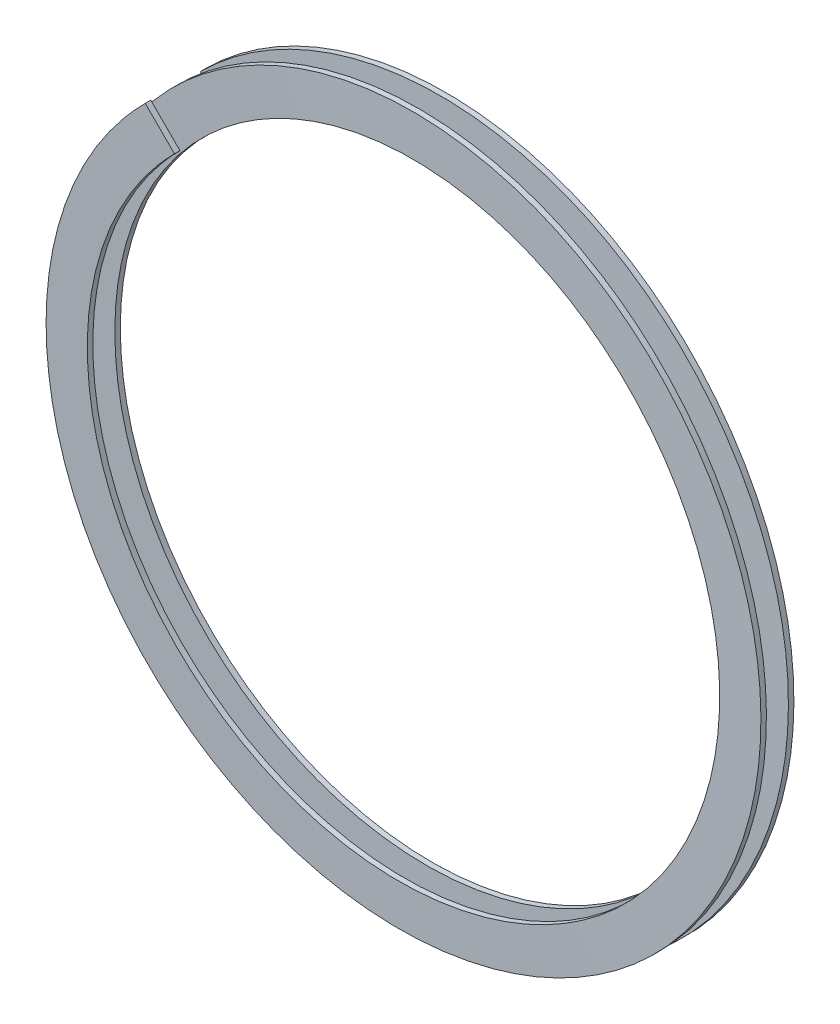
ISO-10303-21;
HEADER;
FILE_DESCRIPTION(('STEP AP214'),'2;1');
FILE_NAME('part.step','',(''),(''),'','','');
FILE_SCHEMA(('AUTOMOTIVE_DESIGN { 1 0 10303 214 1 1 1 1 }'));
ENDSEC;
DATA;
#1=APPLICATION_CONTEXT('core data for automotive mechanical design processes');
#2=APPLICATION_PROTOCOL_DEFINITION('international standard','automotive_design',2000,#1);
#3=PRODUCT_CONTEXT('',#1,'mechanical');
#4=PRODUCT('Part','Part','',(#3));
#5=PRODUCT_RELATED_PRODUCT_CATEGORY('part','',(#4));
#6=PRODUCT_DEFINITION_FORMATION('','',#4);
#7=PRODUCT_DEFINITION_CONTEXT('part definition',#1,'design');
#8=PRODUCT_DEFINITION('design','',#6,#7);
#9=PRODUCT_DEFINITION_SHAPE('','',#8);
#10=(LENGTH_UNIT() NAMED_UNIT(*) SI_UNIT(.MILLI.,.METRE.));
#11=(NAMED_UNIT(*) PLANE_ANGLE_UNIT() SI_UNIT($,.RADIAN.));
#12=(NAMED_UNIT(*) SI_UNIT($,.STERADIAN.) SOLID_ANGLE_UNIT());
#13=UNCERTAINTY_MEASURE_WITH_UNIT(LENGTH_MEASURE(1.E-05),#10,'distance_accuracy_value','');
#14=(GEOMETRIC_REPRESENTATION_CONTEXT(3) GLOBAL_UNCERTAINTY_ASSIGNED_CONTEXT((#13)) GLOBAL_UNIT_ASSIGNED_CONTEXT((#10,
#11,#12)) REPRESENTATION_CONTEXT('',''));
#15=CARTESIAN_POINT('',(0.,0.,0.));
#16=DIRECTION('',(0.,0.,1.));
#17=DIRECTION('',(1.,0.,0.));
#18=AXIS2_PLACEMENT_3D('',#15,#16,#17);
#19=CARTESIAN_POINT('',(-8.48528137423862,8.48528137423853,0.1));
#20=DIRECTION('',(0.707106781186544,0.707106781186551,0.));
#21=DIRECTION('',(-0.707106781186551,0.707106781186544,0.));
#22=AXIS2_PLACEMENT_3D('',#19,#20,#21);
#23=PLANE('',#22);
#24=CARTESIAN_POINT('',(-9.01561146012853,9.01561146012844,0.1));
#25=CARTESIAN_POINT('',(-8.97141728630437,8.97141728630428,0.1));
#26=CARTESIAN_POINT('',(-8.92722311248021,8.92722311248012,0.1));
#27=CARTESIAN_POINT('',(-8.8388347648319,8.8388347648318,0.1));
#28=CARTESIAN_POINT('',(-8.79464059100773,8.79464059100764,0.1));
#29=CARTESIAN_POINT('',(-8.70625224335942,8.70625224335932,0.1));
#30=CARTESIAN_POINT('',(-8.66205806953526,8.66205806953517,0.1));
#31=CARTESIAN_POINT('',(-8.57366972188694,8.57366972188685,0.1));
#32=CARTESIAN_POINT('',(-8.52947554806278,8.52947554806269,0.1));
#33=CARTESIAN_POINT('',(-8.44108720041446,8.44108720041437,0.1));
#34=CARTESIAN_POINT('',(-8.3968930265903,8.39689302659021,0.1));
#35=CARTESIAN_POINT('',(-8.30850467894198,8.30850467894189,0.1));
#36=CARTESIAN_POINT('',(-8.26431050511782,8.26431050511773,0.1));
#37=CARTESIAN_POINT('',(-8.1759221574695,8.17592215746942,0.1));
#38=CARTESIAN_POINT('',(-8.13172798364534,8.13172798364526,0.1));
#39=CARTESIAN_POINT('',(-8.04333963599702,8.04333963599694,0.1));
#40=CARTESIAN_POINT('',(-7.99914546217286,7.99914546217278,0.1));
#41=CARTESIAN_POINT('',(-7.95495128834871,7.95495128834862,0.1));
#42=B_SPLINE_CURVE_WITH_KNOTS('',3,(#24,#25,#26,#27,#28,#29,#30,#31,#32,#33,#34,#35,#36,#37,#38,
#39,#40,#41),.UNSPECIFIED.,.F.,.F.,(4,2,2,2,2,2,2,2,4),(0.,0.187499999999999,0.374999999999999,
0.5625,0.749999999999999,0.937499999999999,1.125,1.3125,1.5),.UNSPECIFIED.);
#43=CARTESIAN_POINT('',(-9.01561146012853,9.01561146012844,0.1));
#44=VERTEX_POINT('',#43);
#45=CARTESIAN_POINT('',(-7.95495128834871,7.95495128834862,0.1));
#46=VERTEX_POINT('',#45);
#47=EDGE_CURVE('E34',#44,#46,#42,.T.);
#48=ORIENTED_EDGE('',*,*,#47,.F.);
#49=CARTESIAN_POINT('',(-9.01561146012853,9.01561146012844,-0.0999999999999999));
#50=CARTESIAN_POINT('',(-9.01561146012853,9.01561146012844,0.1));
#51=(BOUNDED_CURVE() B_SPLINE_CURVE(1,(#49,#50),.UNSPECIFIED.,.F.,
.F.) B_SPLINE_CURVE_WITH_KNOTS((2,2),(0.941176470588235,1.),
.UNSPECIFIED.) CURVE() GEOMETRIC_REPRESENTATION_ITEM() RATIONAL_B_SPLINE_CURVE((1.,1.)) REPRESENTATION_ITEM(''));
#52=CARTESIAN_POINT('',(-9.01561146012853,9.01561146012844,-0.0999999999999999));
#53=VERTEX_POINT('',#52);
#54=EDGE_CURVE('E70',#53,#44,#51,.T.);
#55=ORIENTED_EDGE('',*,*,#54,.F.);
#56=CARTESIAN_POINT('',(-7.95495128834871,7.95495128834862,-0.1));
#57=CARTESIAN_POINT('',(-7.99914546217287,7.99914546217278,-0.1));
#58=CARTESIAN_POINT('',(-8.04333963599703,8.04333963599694,-0.1));
#59=CARTESIAN_POINT('',(-8.13172798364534,8.13172798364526,-0.1));
#60=CARTESIAN_POINT('',(-8.1759221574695,8.17592215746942,-0.1));
#61=CARTESIAN_POINT('',(-8.26431050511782,8.26431050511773,-0.1));
#62=CARTESIAN_POINT('',(-8.30850467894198,8.30850467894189,-0.1));
#63=CARTESIAN_POINT('',(-8.3968930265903,8.39689302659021,-0.1));
#64=CARTESIAN_POINT('',(-8.44108720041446,8.44108720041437,-0.1));
#65=CARTESIAN_POINT('',(-8.52947554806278,8.52947554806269,-0.1));
#66=CARTESIAN_POINT('',(-8.57366972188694,8.57366972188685,-0.1));
#67=CARTESIAN_POINT('',(-8.66205806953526,8.66205806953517,-0.1));
#68=CARTESIAN_POINT('',(-8.70625224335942,8.70625224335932,-0.1));
#69=CARTESIAN_POINT('',(-8.79464059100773,8.79464059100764,-0.0999999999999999));
#70=CARTESIAN_POINT('',(-8.83883476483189,8.8388347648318,-0.0999999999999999));
#71=CARTESIAN_POINT('',(-8.92722311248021,8.92722311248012,-0.0999999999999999));
#72=CARTESIAN_POINT('',(-8.97141728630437,8.97141728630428,-0.0999999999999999));
#73=CARTESIAN_POINT('',(-9.01561146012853,9.01561146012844,-0.0999999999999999));
#74=B_SPLINE_CURVE_WITH_KNOTS('',3,(#56,#57,#58,#59,#60,#61,#62,#63,#64,#65,#66,#67,#68,#69,#70,
#71,#72,#73),.UNSPECIFIED.,.F.,.F.,(4,2,2,2,2,2,2,2,4),(0.,0.187500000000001,0.375,
0.562499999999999,0.750000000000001,0.937499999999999,1.125,1.3125,1.5),.UNSPECIFIED.);
#75=CARTESIAN_POINT('',(-7.95495128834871,7.95495128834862,-0.1));
#76=VERTEX_POINT('',#75);
#77=EDGE_CURVE('E185',#76,#53,#74,.T.);
#78=ORIENTED_EDGE('',*,*,#77,.F.);
#79=CARTESIAN_POINT('',(-7.95495128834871,7.95495128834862,0.1));
#80=CARTESIAN_POINT('',(-7.95495128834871,7.95495128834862,-0.1));
#81=(BOUNDED_CURVE() B_SPLINE_CURVE(1,(#79,#80),.UNSPECIFIED.,.F.,
.F.) B_SPLINE_CURVE_WITH_KNOTS((2,2),(0.441176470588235,0.5),
.UNSPECIFIED.) CURVE() GEOMETRIC_REPRESENTATION_ITEM() RATIONAL_B_SPLINE_CURVE((1.,1.)) REPRESENTATION_ITEM(''));
#82=EDGE_CURVE('E41',#46,#76,#81,.T.);
#83=ORIENTED_EDGE('',*,*,#82,.F.);
#84=EDGE_LOOP('',(#48,#55,#78,#83));
#85=FACE_BOUND('',#84,.T.);
#86=ADVANCED_FACE('F24',(#85),#23,.F.);
#87=CARTESIAN_POINT('',(-8.48528137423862,8.48528137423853,2.1));
#88=DIRECTION('',(-0.707106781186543,-0.707106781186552,0.));
#89=DIRECTION('',(0.707106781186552,-0.707106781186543,0.));
#90=AXIS2_PLACEMENT_3D('',#87,#88,#89);
#91=PLANE('',#90);
#92=CARTESIAN_POINT('',(-7.95495128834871,7.95495128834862,2.1));
#93=CARTESIAN_POINT('',(-9.01561146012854,9.01561146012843,2.1));
#94=(BOUNDED_CURVE() B_SPLINE_CURVE(1,(#92,#93),.UNSPECIFIED.,.F.,
.F.) B_SPLINE_CURVE_WITH_KNOTS((2,2),(0.,0.441176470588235),
.UNSPECIFIED.) CURVE() GEOMETRIC_REPRESENTATION_ITEM() RATIONAL_B_SPLINE_CURVE((1.,1.)) REPRESENTATION_ITEM(''));
#95=CARTESIAN_POINT('',(-9.01561146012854,9.01561146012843,2.1));
#96=VERTEX_POINT('',#95);
#97=CARTESIAN_POINT('',(-7.95495128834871,7.95495128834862,2.1));
#98=VERTEX_POINT('',#97);
#99=EDGE_CURVE('E11',#96,#98,#94,.F.);
#100=ORIENTED_EDGE('',*,*,#99,.T.);
#101=DIRECTION('',(0.,0.,-1.));
#102=VECTOR('',#101,1.);
#103=CARTESIAN_POINT('',(-7.95495128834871,7.95495128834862,2.));
#104=LINE('',#103,#102);
#105=CARTESIAN_POINT('',(-7.95495128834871,7.95495128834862,1.9));
#106=VERTEX_POINT('',#105);
#107=EDGE_CURVE('E49',#98,#106,#104,.T.);
#108=ORIENTED_EDGE('',*,*,#107,.T.);
#109=DIRECTION('',(-0.707106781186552,0.707106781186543,0.));
#110=VECTOR('',#109,1.);
#111=CARTESIAN_POINT('',(-8.48528137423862,8.48528137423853,1.9));
#112=LINE('',#111,#110);
#113=CARTESIAN_POINT('',(-9.01561146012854,9.01561146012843,1.9));
#114=VERTEX_POINT('',#113);
#115=EDGE_CURVE('E131',#106,#114,#112,.T.);
#116=ORIENTED_EDGE('',*,*,#115,.T.);
#117=DIRECTION('',(0.,0.,1.));
#118=VECTOR('',#117,1.);
#119=CARTESIAN_POINT('',(-9.01561146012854,9.01561146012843,2.));
#120=LINE('',#119,#118);
#121=EDGE_CURVE('E80',#114,#96,#120,.T.);
#122=ORIENTED_EDGE('',*,*,#121,.T.);
#123=EDGE_LOOP('',(#100,#108,#116,#122));
#124=FACE_BOUND('',#123,.T.);
#125=ADVANCED_FACE('F26',(#124),#91,.F.);
#126=CARTESIAN_POINT('',(-9.01561146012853,9.01561146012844,0.1));
#127=CARTESIAN_POINT('',(-3.81044575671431,14.2207771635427,0.183333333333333));
#128=CARTESIAN_POINT('',(3.29994282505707,12.3155542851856,0.266666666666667));
#129=CARTESIAN_POINT('',(10.4103314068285,10.4103314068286,0.35));
#130=CARTESIAN_POINT('',(12.3155542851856,3.29994282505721,0.433333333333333));
#131=CARTESIAN_POINT('',(14.2207771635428,-3.81044575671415,0.516666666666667));
#132=CARTESIAN_POINT('',(9.01561146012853,-9.01561146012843,0.6));
#133=CARTESIAN_POINT('',(3.81044575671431,-14.2207771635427,0.683333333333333));
#134=CARTESIAN_POINT('',(-3.29994282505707,-12.3155542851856,0.766666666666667));
#135=CARTESIAN_POINT('',(-10.4103314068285,-10.4103314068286,0.85));
#136=CARTESIAN_POINT('',(-12.3155542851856,-3.29994282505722,0.933333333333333));
#137=CARTESIAN_POINT('',(-14.2207771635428,3.81044575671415,1.01666666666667));
#138=CARTESIAN_POINT('',(-9.01561146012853,9.01561146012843,1.1));
#139=CARTESIAN_POINT('',(-3.81044575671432,14.2207771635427,1.18333333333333));
#140=CARTESIAN_POINT('',(3.29994282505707,12.3155542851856,1.26666666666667));
#141=CARTESIAN_POINT('',(10.4103314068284,10.4103314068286,1.35));
#142=CARTESIAN_POINT('',(12.3155542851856,3.29994282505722,1.43333333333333));
#143=CARTESIAN_POINT('',(14.2207771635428,-3.81044575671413,1.51666666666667));
#144=CARTESIAN_POINT('',(9.01561146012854,-9.01561146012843,1.6));
#145=CARTESIAN_POINT('',(3.81044575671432,-14.2207771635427,1.68333333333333));
#146=CARTESIAN_POINT('',(-3.29994282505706,-12.3155542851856,1.76666666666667));
#147=CARTESIAN_POINT('',(-10.4103314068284,-10.4103314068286,1.85));
#148=CARTESIAN_POINT('',(-12.3155542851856,-3.29994282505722,1.93333333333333));
#149=CARTESIAN_POINT('',(-14.2207771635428,3.81044575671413,2.01666666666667));
#150=CARTESIAN_POINT('',(-9.01561146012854,9.01561146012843,2.1));
#151=CARTESIAN_POINT('',(-7.95495128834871,7.95495128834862,0.1));
#152=CARTESIAN_POINT('',(-3.36215802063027,12.5477445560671,0.183333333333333));
#153=CARTESIAN_POINT('',(2.9117142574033,10.866665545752,0.266666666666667));
#154=CARTESIAN_POINT('',(9.18558653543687,9.18558653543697,0.35));
#155=CARTESIAN_POINT('',(10.866665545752,2.91171425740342,0.433333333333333));
#156=CARTESIAN_POINT('',(12.5477445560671,-3.36215802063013,0.516666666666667));
#157=CARTESIAN_POINT('',(7.95495128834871,-7.95495128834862,0.6));
#158=CARTESIAN_POINT('',(3.36215802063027,-12.5477445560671,0.683333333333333));
#159=CARTESIAN_POINT('',(-2.9117142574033,-10.866665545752,0.766666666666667));
#160=CARTESIAN_POINT('',(-9.18558653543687,-9.18558653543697,0.85));
#161=CARTESIAN_POINT('',(-10.866665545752,-2.91171425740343,0.933333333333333));
#162=CARTESIAN_POINT('',(-12.5477445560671,3.36215802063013,1.01666666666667));
#163=CARTESIAN_POINT('',(-7.95495128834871,7.95495128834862,1.1));
#164=CARTESIAN_POINT('',(-3.36215802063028,12.5477445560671,1.18333333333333));
#165=CARTESIAN_POINT('',(2.9117142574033,10.866665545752,1.26666666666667));
#166=CARTESIAN_POINT('',(9.18558653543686,9.18558653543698,1.35));
#167=CARTESIAN_POINT('',(10.866665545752,2.91171425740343,1.43333333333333));
#168=CARTESIAN_POINT('',(12.5477445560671,-3.36215802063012,1.51666666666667));
#169=CARTESIAN_POINT('',(7.95495128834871,-7.95495128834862,1.6));
#170=CARTESIAN_POINT('',(3.36215802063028,-12.5477445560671,1.68333333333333));
#171=CARTESIAN_POINT('',(-2.91171425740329,-10.866665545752,1.76666666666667));
#172=CARTESIAN_POINT('',(-9.18558653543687,-9.18558653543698,1.85));
#173=CARTESIAN_POINT('',(-10.866665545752,-2.91171425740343,1.93333333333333));
#174=CARTESIAN_POINT('',(-12.5477445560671,3.36215802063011,2.01666666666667));
#175=CARTESIAN_POINT('',(-7.95495128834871,7.95495128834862,2.1));
#176=(BOUNDED_SURFACE() B_SPLINE_SURFACE(1,2,((#126,#127,#128,#129,#130,#131,#132,#133,#134,
#135,#136,#137,#138,#139,#140,#141,#142,#143,#144,#145,#146,#147,#148,#149,#150),(#151,#152,
#153,#154,#155,#156,#157,#158,#159,#160,#161,#162,#163,#164,#165,#166,#167,#168,#169,#170,#171,
#172,#173,#174,#175)),.UNSPECIFIED.,.F.,.F.,.F.) B_SPLINE_SURFACE_WITH_KNOTS((2,2),(3,2,2,2,2,2,
2,2,2,2,2,2,3),(0.,0.441176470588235),(0.,0.0833333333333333,0.166666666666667,0.25,
0.333333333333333,0.416666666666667,0.5,0.583333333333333,0.666666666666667,0.75,
0.833333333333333,0.916666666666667,1.),
.UNSPECIFIED.) GEOMETRIC_REPRESENTATION_ITEM() RATIONAL_B_SPLINE_SURFACE(((1.,0.866025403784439,
1.,0.866025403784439,1.,0.866025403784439,1.,0.866025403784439,1.,0.866025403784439,1.,
0.866025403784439,1.,0.866025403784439,1.,0.866025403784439,1.,0.866025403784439,1.,
0.866025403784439,1.,0.866025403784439,1.,0.866025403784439,1.),(1.,0.866025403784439,1.,
0.866025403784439,1.,0.866025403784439,1.,0.866025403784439,1.,0.866025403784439,1.,
0.866025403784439,1.,0.866025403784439,1.,0.866025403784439,1.,0.866025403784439,1.,
0.866025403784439,1.,0.866025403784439,1.,0.866025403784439,1.))) REPRESENTATION_ITEM('') SURFACE());
#177=CARTESIAN_POINT('',(-7.95495128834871,7.95495128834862,0.1));
#178=CARTESIAN_POINT('',(-3.36215802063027,12.5477445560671,0.183333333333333));
#179=CARTESIAN_POINT('',(2.9117142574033,10.866665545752,0.266666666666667));
#180=CARTESIAN_POINT('',(9.18558653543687,9.18558653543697,0.35));
#181=CARTESIAN_POINT('',(10.866665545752,2.91171425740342,0.433333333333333));
#182=CARTESIAN_POINT('',(12.5477445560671,-3.36215802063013,0.516666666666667));
#183=CARTESIAN_POINT('',(7.95495128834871,-7.95495128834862,0.6));
#184=CARTESIAN_POINT('',(3.36215802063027,-12.5477445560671,0.683333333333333));
#185=CARTESIAN_POINT('',(-2.9117142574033,-10.866665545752,0.766666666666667));
#186=CARTESIAN_POINT('',(-9.18558653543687,-9.18558653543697,0.85));
#187=CARTESIAN_POINT('',(-10.866665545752,-2.91171425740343,0.933333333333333));
#188=CARTESIAN_POINT('',(-12.5477445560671,3.36215802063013,1.01666666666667));
#189=CARTESIAN_POINT('',(-7.95495128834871,7.95495128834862,1.1));
#190=CARTESIAN_POINT('',(-3.36215802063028,12.5477445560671,1.18333333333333));
#191=CARTESIAN_POINT('',(2.9117142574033,10.866665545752,1.26666666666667));
#192=CARTESIAN_POINT('',(9.18558653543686,9.18558653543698,1.35));
#193=CARTESIAN_POINT('',(10.866665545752,2.91171425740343,1.43333333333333));
#194=CARTESIAN_POINT('',(12.5477445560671,-3.36215802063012,1.51666666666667));
#195=CARTESIAN_POINT('',(7.95495128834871,-7.95495128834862,1.6));
#196=CARTESIAN_POINT('',(3.36215802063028,-12.5477445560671,1.68333333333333));
#197=CARTESIAN_POINT('',(-2.91171425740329,-10.866665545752,1.76666666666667));
#198=CARTESIAN_POINT('',(-9.18558653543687,-9.18558653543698,1.85));
#199=CARTESIAN_POINT('',(-10.866665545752,-2.91171425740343,1.93333333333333));
#200=CARTESIAN_POINT('',(-12.5477445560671,3.36215802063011,2.01666666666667));
#201=CARTESIAN_POINT('',(-7.95495128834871,7.95495128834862,2.1));
#202=(BOUNDED_CURVE() B_SPLINE_CURVE(2,(#177,#178,#179,#180,#181,#182,#183,#184,#185,#186,#187,
#188,#189,#190,#191,#192,#193,#194,#195,#196,#197,#198,#199,#200,#201),.UNSPECIFIED.,.F.,
.F.) B_SPLINE_CURVE_WITH_KNOTS((3,2,2,2,2,2,2,2,2,2,2,2,3),(0.,0.0833333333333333,
0.166666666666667,0.25,0.333333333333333,0.416666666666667,0.5,0.583333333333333,
0.666666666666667,0.75,0.833333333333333,0.916666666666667,1.),
.UNSPECIFIED.) CURVE() GEOMETRIC_REPRESENTATION_ITEM() RATIONAL_B_SPLINE_CURVE((1.,
0.866025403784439,1.,0.866025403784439,1.,0.866025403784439,1.,0.866025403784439,1.,
0.866025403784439,1.,0.866025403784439,1.,0.866025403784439,1.,0.866025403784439,1.,
0.866025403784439,1.,0.866025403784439,1.,0.866025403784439,1.,0.866025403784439,1.)) REPRESENTATION_ITEM(''));
#203=EDGE_CURVE('E90',#46,#98,#202,.T.);
#204=CARTESIAN_POINT('',(-9.01561146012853,9.01561146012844,0.1));
#205=CARTESIAN_POINT('',(-3.81044575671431,14.2207771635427,0.183333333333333));
#206=CARTESIAN_POINT('',(3.29994282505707,12.3155542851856,0.266666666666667));
#207=CARTESIAN_POINT('',(10.4103314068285,10.4103314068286,0.35));
#208=CARTESIAN_POINT('',(12.3155542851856,3.29994282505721,0.433333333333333));
#209=CARTESIAN_POINT('',(14.2207771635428,-3.81044575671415,0.516666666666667));
#210=CARTESIAN_POINT('',(9.01561146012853,-9.01561146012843,0.6));
#211=CARTESIAN_POINT('',(3.81044575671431,-14.2207771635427,0.683333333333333));
#212=CARTESIAN_POINT('',(-3.29994282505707,-12.3155542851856,0.766666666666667));
#213=CARTESIAN_POINT('',(-10.4103314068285,-10.4103314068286,0.85));
#214=CARTESIAN_POINT('',(-12.3155542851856,-3.29994282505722,0.933333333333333));
#215=CARTESIAN_POINT('',(-14.2207771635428,3.81044575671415,1.01666666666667));
#216=CARTESIAN_POINT('',(-9.01561146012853,9.01561146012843,1.1));
#217=CARTESIAN_POINT('',(-3.81044575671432,14.2207771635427,1.18333333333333));
#218=CARTESIAN_POINT('',(3.29994282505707,12.3155542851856,1.26666666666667));
#219=CARTESIAN_POINT('',(10.4103314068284,10.4103314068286,1.35));
#220=CARTESIAN_POINT('',(12.3155542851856,3.29994282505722,1.43333333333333));
#221=CARTESIAN_POINT('',(14.2207771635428,-3.81044575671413,1.51666666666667));
#222=CARTESIAN_POINT('',(9.01561146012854,-9.01561146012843,1.6));
#223=CARTESIAN_POINT('',(3.81044575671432,-14.2207771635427,1.68333333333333));
#224=CARTESIAN_POINT('',(-3.29994282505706,-12.3155542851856,1.76666666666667));
#225=CARTESIAN_POINT('',(-10.4103314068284,-10.4103314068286,1.85));
#226=CARTESIAN_POINT('',(-12.3155542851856,-3.29994282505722,1.93333333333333));
#227=CARTESIAN_POINT('',(-14.2207771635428,3.81044575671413,2.01666666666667));
#228=CARTESIAN_POINT('',(-9.01561146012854,9.01561146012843,2.1));
#229=(BOUNDED_CURVE() B_SPLINE_CURVE(2,(#204,#205,#206,#207,#208,#209,#210,#211,#212,#213,#214,
#215,#216,#217,#218,#219,#220,#221,#222,#223,#224,#225,#226,#227,#228),.UNSPECIFIED.,.F.,
.F.) B_SPLINE_CURVE_WITH_KNOTS((3,2,2,2,2,2,2,2,2,2,2,2,3),(0.,0.0833333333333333,
0.166666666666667,0.25,0.333333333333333,0.416666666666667,0.5,0.583333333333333,
0.666666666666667,0.75,0.833333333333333,0.916666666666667,1.),
.UNSPECIFIED.) CURVE() GEOMETRIC_REPRESENTATION_ITEM() RATIONAL_B_SPLINE_CURVE((1.,
0.866025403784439,1.,0.866025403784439,1.,0.866025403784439,1.,0.866025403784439,1.,
0.866025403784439,1.,0.866025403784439,1.,0.866025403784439,1.,0.866025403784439,1.,
0.866025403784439,1.,0.866025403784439,1.,0.866025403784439,1.,0.866025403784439,1.)) REPRESENTATION_ITEM(''));
#230=EDGE_CURVE('E74',#44,#96,#229,.T.);
#231=ORIENTED_EDGE('',*,*,#47,.T.);
#232=ORIENTED_EDGE('',*,*,#203,.T.);
#233=ORIENTED_EDGE('',*,*,#99,.F.);
#234=ORIENTED_EDGE('',*,*,#230,.F.);
#235=EDGE_LOOP('',(#231,#232,#233,#234));
#236=FACE_BOUND('',#235,.T.);
#237=ADVANCED_FACE('F85',(#236),#176,.T.);
#238=CARTESIAN_POINT('',(-7.95495128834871,7.95495128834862,0.1));
#239=CARTESIAN_POINT('',(-3.36215802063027,12.5477445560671,0.183333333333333));
#240=CARTESIAN_POINT('',(2.9117142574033,10.866665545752,0.266666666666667));
#241=CARTESIAN_POINT('',(9.18558653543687,9.18558653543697,0.35));
#242=CARTESIAN_POINT('',(10.866665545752,2.91171425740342,0.433333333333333));
#243=CARTESIAN_POINT('',(12.5477445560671,-3.36215802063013,0.516666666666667));
#244=CARTESIAN_POINT('',(7.95495128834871,-7.95495128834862,0.6));
#245=CARTESIAN_POINT('',(3.36215802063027,-12.5477445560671,0.683333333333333));
#246=CARTESIAN_POINT('',(-2.9117142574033,-10.866665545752,0.766666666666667));
#247=CARTESIAN_POINT('',(-9.18558653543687,-9.18558653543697,0.85));
#248=CARTESIAN_POINT('',(-10.866665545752,-2.91171425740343,0.933333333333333));
#249=CARTESIAN_POINT('',(-12.5477445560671,3.36215802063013,1.01666666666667));
#250=CARTESIAN_POINT('',(-7.95495128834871,7.95495128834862,1.1));
#251=CARTESIAN_POINT('',(-3.36215802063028,12.5477445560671,1.18333333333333));
#252=CARTESIAN_POINT('',(2.9117142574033,10.866665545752,1.26666666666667));
#253=CARTESIAN_POINT('',(9.18558653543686,9.18558653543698,1.35));
#254=CARTESIAN_POINT('',(10.866665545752,2.91171425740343,1.43333333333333));
#255=CARTESIAN_POINT('',(12.5477445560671,-3.36215802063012,1.51666666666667));
#256=CARTESIAN_POINT('',(7.95495128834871,-7.95495128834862,1.6));
#257=CARTESIAN_POINT('',(3.36215802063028,-12.5477445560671,1.68333333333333));
#258=CARTESIAN_POINT('',(-2.91171425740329,-10.866665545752,1.76666666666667));
#259=CARTESIAN_POINT('',(-9.18558653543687,-9.18558653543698,1.85));
#260=CARTESIAN_POINT('',(-10.866665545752,-2.91171425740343,1.93333333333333));
#261=CARTESIAN_POINT('',(-12.5477445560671,3.36215802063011,2.01666666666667));
#262=CARTESIAN_POINT('',(-7.95495128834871,7.95495128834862,2.1));
#263=CARTESIAN_POINT('',(-7.95495128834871,7.95495128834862,-0.1));
#264=CARTESIAN_POINT('',(-3.36215802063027,12.5477445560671,-0.0166666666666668));
#265=CARTESIAN_POINT('',(2.9117142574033,10.866665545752,0.0666666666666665));
#266=CARTESIAN_POINT('',(9.18558653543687,9.18558653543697,0.15));
#267=CARTESIAN_POINT('',(10.866665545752,2.91171425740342,0.233333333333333));
#268=CARTESIAN_POINT('',(12.5477445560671,-3.36215802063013,0.316666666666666));
#269=CARTESIAN_POINT('',(7.95495128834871,-7.95495128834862,0.4));
#270=CARTESIAN_POINT('',(3.36215802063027,-12.5477445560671,0.483333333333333));
#271=CARTESIAN_POINT('',(-2.9117142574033,-10.866665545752,0.566666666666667));
#272=CARTESIAN_POINT('',(-9.18558653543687,-9.18558653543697,0.65));
#273=CARTESIAN_POINT('',(-10.866665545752,-2.91171425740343,0.733333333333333));
#274=CARTESIAN_POINT('',(-12.5477445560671,3.36215802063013,0.816666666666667));
#275=CARTESIAN_POINT('',(-7.95495128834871,7.95495128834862,0.9));
#276=CARTESIAN_POINT('',(-3.36215802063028,12.5477445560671,0.983333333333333));
#277=CARTESIAN_POINT('',(2.9117142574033,10.866665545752,1.06666666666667));
#278=CARTESIAN_POINT('',(9.18558653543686,9.18558653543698,1.15));
#279=CARTESIAN_POINT('',(10.866665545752,2.91171425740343,1.23333333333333));
#280=CARTESIAN_POINT('',(12.5477445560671,-3.36215802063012,1.31666666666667));
#281=CARTESIAN_POINT('',(7.95495128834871,-7.95495128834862,1.4));
#282=CARTESIAN_POINT('',(3.36215802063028,-12.5477445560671,1.48333333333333));
#283=CARTESIAN_POINT('',(-2.91171425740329,-10.866665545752,1.56666666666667));
#284=CARTESIAN_POINT('',(-9.18558653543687,-9.18558653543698,1.65));
#285=CARTESIAN_POINT('',(-10.866665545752,-2.91171425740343,1.73333333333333));
#286=CARTESIAN_POINT('',(-12.5477445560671,3.36215802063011,1.81666666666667));
#287=CARTESIAN_POINT('',(-7.95495128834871,7.95495128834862,1.9));
#288=(BOUNDED_SURFACE() B_SPLINE_SURFACE(1,2,((#238,#239,#240,#241,#242,#243,#244,#245,#246,
#247,#248,#249,#250,#251,#252,#253,#254,#255,#256,#257,#258,#259,#260,#261,#262),(#263,#264,
#265,#266,#267,#268,#269,#270,#271,#272,#273,#274,#275,#276,#277,#278,#279,#280,#281,#282,#283,
#284,#285,#286,#287)),.UNSPECIFIED.,.F.,.F.,.F.) B_SPLINE_SURFACE_WITH_KNOTS((2,2),(3,2,2,2,2,2,
2,2,2,2,2,2,3),(0.441176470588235,0.5),(0.,0.0833333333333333,0.166666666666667,0.25,
0.333333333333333,0.416666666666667,0.5,0.583333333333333,0.666666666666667,0.75,
0.833333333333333,0.916666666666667,1.),
.UNSPECIFIED.) GEOMETRIC_REPRESENTATION_ITEM() RATIONAL_B_SPLINE_SURFACE(((1.,0.866025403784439,
1.,0.866025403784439,1.,0.866025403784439,1.,0.866025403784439,1.,0.866025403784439,1.,
0.866025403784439,1.,0.866025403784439,1.,0.866025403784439,1.,0.866025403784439,1.,
0.866025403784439,1.,0.866025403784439,1.,0.866025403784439,1.),(1.,0.866025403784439,1.,
0.866025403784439,1.,0.866025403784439,1.,0.866025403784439,1.,0.866025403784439,1.,
0.866025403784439,1.,0.866025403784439,1.,0.866025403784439,1.,0.866025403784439,1.,
0.866025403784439,1.,0.866025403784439,1.,0.866025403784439,1.))) REPRESENTATION_ITEM('') SURFACE());
#289=CARTESIAN_POINT('',(-7.95495128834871,7.95495128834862,-0.1));
#290=CARTESIAN_POINT('',(-3.36215802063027,12.5477445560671,-0.0166666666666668));
#291=CARTESIAN_POINT('',(2.9117142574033,10.866665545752,0.0666666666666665));
#292=CARTESIAN_POINT('',(9.18558653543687,9.18558653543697,0.15));
#293=CARTESIAN_POINT('',(10.866665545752,2.91171425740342,0.233333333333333));
#294=CARTESIAN_POINT('',(12.5477445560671,-3.36215802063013,0.316666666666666));
#295=CARTESIAN_POINT('',(7.95495128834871,-7.95495128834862,0.4));
#296=CARTESIAN_POINT('',(3.36215802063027,-12.5477445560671,0.483333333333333));
#297=CARTESIAN_POINT('',(-2.9117142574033,-10.866665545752,0.566666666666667));
#298=CARTESIAN_POINT('',(-9.18558653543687,-9.18558653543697,0.65));
#299=CARTESIAN_POINT('',(-10.866665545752,-2.91171425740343,0.733333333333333));
#300=CARTESIAN_POINT('',(-12.5477445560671,3.36215802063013,0.816666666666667));
#301=CARTESIAN_POINT('',(-7.95495128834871,7.95495128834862,0.9));
#302=CARTESIAN_POINT('',(-3.36215802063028,12.5477445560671,0.983333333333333));
#303=CARTESIAN_POINT('',(2.9117142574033,10.866665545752,1.06666666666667));
#304=CARTESIAN_POINT('',(9.18558653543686,9.18558653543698,1.15));
#305=CARTESIAN_POINT('',(10.866665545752,2.91171425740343,1.23333333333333));
#306=CARTESIAN_POINT('',(12.5477445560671,-3.36215802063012,1.31666666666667));
#307=CARTESIAN_POINT('',(7.95495128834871,-7.95495128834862,1.4));
#308=CARTESIAN_POINT('',(3.36215802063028,-12.5477445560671,1.48333333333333));
#309=CARTESIAN_POINT('',(-2.91171425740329,-10.866665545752,1.56666666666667));
#310=CARTESIAN_POINT('',(-9.18558653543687,-9.18558653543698,1.65));
#311=CARTESIAN_POINT('',(-10.866665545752,-2.91171425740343,1.73333333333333));
#312=CARTESIAN_POINT('',(-12.5477445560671,3.36215802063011,1.81666666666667));
#313=CARTESIAN_POINT('',(-7.95495128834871,7.95495128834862,1.9));
#314=(BOUNDED_CURVE() B_SPLINE_CURVE(2,(#289,#290,#291,#292,#293,#294,#295,#296,#297,#298,#299,
#300,#301,#302,#303,#304,#305,#306,#307,#308,#309,#310,#311,#312,#313),.UNSPECIFIED.,.F.,
.F.) B_SPLINE_CURVE_WITH_KNOTS((3,2,2,2,2,2,2,2,2,2,2,2,3),(0.,0.0833333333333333,
0.166666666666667,0.25,0.333333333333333,0.416666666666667,0.5,0.583333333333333,
0.666666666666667,0.75,0.833333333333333,0.916666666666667,1.),
.UNSPECIFIED.) CURVE() GEOMETRIC_REPRESENTATION_ITEM() RATIONAL_B_SPLINE_CURVE((1.,
0.866025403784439,1.,0.866025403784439,1.,0.866025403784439,1.,0.866025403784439,1.,
0.866025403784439,1.,0.866025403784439,1.,0.866025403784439,1.,0.866025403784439,1.,
0.866025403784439,1.,0.866025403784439,1.,0.866025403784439,1.,0.866025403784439,1.)) REPRESENTATION_ITEM(''));
#315=EDGE_CURVE('E124',#76,#106,#314,.T.);
#316=ORIENTED_EDGE('',*,*,#82,.T.);
#317=ORIENTED_EDGE('',*,*,#315,.T.);
#318=ORIENTED_EDGE('',*,*,#107,.F.);
#319=ORIENTED_EDGE('',*,*,#203,.F.);
#320=EDGE_LOOP('',(#316,#317,#318,#319));
#321=FACE_BOUND('',#320,.T.);
#322=ADVANCED_FACE('F142',(#321),#288,.T.);
#323=CARTESIAN_POINT('',(-7.95495128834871,7.95495128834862,-0.1));
#324=CARTESIAN_POINT('',(-3.36215802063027,12.5477445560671,-0.0166666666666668));
#325=CARTESIAN_POINT('',(2.9117142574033,10.866665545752,0.0666666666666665));
#326=CARTESIAN_POINT('',(9.18558653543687,9.18558653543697,0.15));
#327=CARTESIAN_POINT('',(10.866665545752,2.91171425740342,0.233333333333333));
#328=CARTESIAN_POINT('',(12.5477445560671,-3.36215802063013,0.316666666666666));
#329=CARTESIAN_POINT('',(7.95495128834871,-7.95495128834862,0.4));
#330=CARTESIAN_POINT('',(3.36215802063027,-12.5477445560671,0.483333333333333));
#331=CARTESIAN_POINT('',(-2.9117142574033,-10.866665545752,0.566666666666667));
#332=CARTESIAN_POINT('',(-9.18558653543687,-9.18558653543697,0.65));
#333=CARTESIAN_POINT('',(-10.866665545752,-2.91171425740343,0.733333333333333));
#334=CARTESIAN_POINT('',(-12.5477445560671,3.36215802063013,0.816666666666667));
#335=CARTESIAN_POINT('',(-7.95495128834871,7.95495128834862,0.9));
#336=CARTESIAN_POINT('',(-3.36215802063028,12.5477445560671,0.983333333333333));
#337=CARTESIAN_POINT('',(2.9117142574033,10.866665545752,1.06666666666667));
#338=CARTESIAN_POINT('',(9.18558653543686,9.18558653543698,1.15));
#339=CARTESIAN_POINT('',(10.866665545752,2.91171425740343,1.23333333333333));
#340=CARTESIAN_POINT('',(12.5477445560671,-3.36215802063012,1.31666666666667));
#341=CARTESIAN_POINT('',(7.95495128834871,-7.95495128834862,1.4));
#342=CARTESIAN_POINT('',(3.36215802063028,-12.5477445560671,1.48333333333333));
#343=CARTESIAN_POINT('',(-2.91171425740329,-10.866665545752,1.56666666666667));
#344=CARTESIAN_POINT('',(-9.18558653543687,-9.18558653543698,1.65));
#345=CARTESIAN_POINT('',(-10.866665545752,-2.91171425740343,1.73333333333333));
#346=CARTESIAN_POINT('',(-12.5477445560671,3.36215802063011,1.81666666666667));
#347=CARTESIAN_POINT('',(-7.95495128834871,7.95495128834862,1.9));
#348=CARTESIAN_POINT('',(-9.01561146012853,9.01561146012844,-0.0999999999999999));
#349=CARTESIAN_POINT('',(-3.81044575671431,14.2207771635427,-0.0166666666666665));
#350=CARTESIAN_POINT('',(3.29994282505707,12.3155542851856,0.0666666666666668));
#351=CARTESIAN_POINT('',(10.4103314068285,10.4103314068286,0.15));
#352=CARTESIAN_POINT('',(12.3155542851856,3.29994282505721,0.233333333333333));
#353=CARTESIAN_POINT('',(14.2207771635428,-3.81044575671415,0.316666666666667));
#354=CARTESIAN_POINT('',(9.01561146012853,-9.01561146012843,0.4));
#355=CARTESIAN_POINT('',(3.81044575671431,-14.2207771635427,0.483333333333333));
#356=CARTESIAN_POINT('',(-3.29994282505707,-12.3155542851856,0.566666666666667));
#357=CARTESIAN_POINT('',(-10.4103314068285,-10.4103314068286,0.65));
#358=CARTESIAN_POINT('',(-12.3155542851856,-3.29994282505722,0.733333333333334));
#359=CARTESIAN_POINT('',(-14.2207771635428,3.81044575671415,0.816666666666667));
#360=CARTESIAN_POINT('',(-9.01561146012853,9.01561146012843,0.9));
#361=CARTESIAN_POINT('',(-3.81044575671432,14.2207771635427,0.983333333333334));
#362=CARTESIAN_POINT('',(3.29994282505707,12.3155542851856,1.06666666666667));
#363=CARTESIAN_POINT('',(10.4103314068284,10.4103314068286,1.15));
#364=CARTESIAN_POINT('',(12.3155542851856,3.29994282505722,1.23333333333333));
#365=CARTESIAN_POINT('',(14.2207771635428,-3.81044575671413,1.31666666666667));
#366=CARTESIAN_POINT('',(9.01561146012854,-9.01561146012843,1.4));
#367=CARTESIAN_POINT('',(3.81044575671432,-14.2207771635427,1.48333333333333));
#368=CARTESIAN_POINT('',(-3.29994282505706,-12.3155542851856,1.56666666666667));
#369=CARTESIAN_POINT('',(-10.4103314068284,-10.4103314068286,1.65));
#370=CARTESIAN_POINT('',(-12.3155542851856,-3.29994282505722,1.73333333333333));
#371=CARTESIAN_POINT('',(-14.2207771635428,3.81044575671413,1.81666666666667));
#372=CARTESIAN_POINT('',(-9.01561146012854,9.01561146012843,1.9));
#373=(BOUNDED_SURFACE() B_SPLINE_SURFACE(1,2,((#323,#324,#325,#326,#327,#328,#329,#330,#331,
#332,#333,#334,#335,#336,#337,#338,#339,#340,#341,#342,#343,#344,#345,#346,#347),(#348,#349,
#350,#351,#352,#353,#354,#355,#356,#357,#358,#359,#360,#361,#362,#363,#364,#365,#366,#367,#368,
#369,#370,#371,#372)),.UNSPECIFIED.,.F.,.F.,.F.) B_SPLINE_SURFACE_WITH_KNOTS((2,2),(3,2,2,2,2,2,
2,2,2,2,2,2,3),(0.5,0.941176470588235),(0.,0.0833333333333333,0.166666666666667,0.25,
0.333333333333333,0.416666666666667,0.5,0.583333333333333,0.666666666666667,0.75,
0.833333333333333,0.916666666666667,1.),
.UNSPECIFIED.) GEOMETRIC_REPRESENTATION_ITEM() RATIONAL_B_SPLINE_SURFACE(((1.,0.866025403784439,
1.,0.866025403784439,1.,0.866025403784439,1.,0.866025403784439,1.,0.866025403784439,1.,
0.866025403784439,1.,0.866025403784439,1.,0.866025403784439,1.,0.866025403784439,1.,
0.866025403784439,1.,0.866025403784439,1.,0.866025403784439,1.),(1.,0.866025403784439,1.,
0.866025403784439,1.,0.866025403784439,1.,0.866025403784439,1.,0.866025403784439,1.,
0.866025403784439,1.,0.866025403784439,1.,0.866025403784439,1.,0.866025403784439,1.,
0.866025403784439,1.,0.866025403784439,1.,0.866025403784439,1.))) REPRESENTATION_ITEM('') SURFACE());
#374=CARTESIAN_POINT('',(-9.01561146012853,9.01561146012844,-0.0999999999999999));
#375=CARTESIAN_POINT('',(-3.81044575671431,14.2207771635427,-0.0166666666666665));
#376=CARTESIAN_POINT('',(3.29994282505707,12.3155542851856,0.0666666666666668));
#377=CARTESIAN_POINT('',(10.4103314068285,10.4103314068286,0.15));
#378=CARTESIAN_POINT('',(12.3155542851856,3.29994282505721,0.233333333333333));
#379=CARTESIAN_POINT('',(14.2207771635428,-3.81044575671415,0.316666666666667));
#380=CARTESIAN_POINT('',(9.01561146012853,-9.01561146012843,0.4));
#381=CARTESIAN_POINT('',(3.81044575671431,-14.2207771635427,0.483333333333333));
#382=CARTESIAN_POINT('',(-3.29994282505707,-12.3155542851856,0.566666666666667));
#383=CARTESIAN_POINT('',(-10.4103314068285,-10.4103314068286,0.65));
#384=CARTESIAN_POINT('',(-12.3155542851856,-3.29994282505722,0.733333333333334));
#385=CARTESIAN_POINT('',(-14.2207771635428,3.81044575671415,0.816666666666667));
#386=CARTESIAN_POINT('',(-9.01561146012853,9.01561146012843,0.9));
#387=CARTESIAN_POINT('',(-3.81044575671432,14.2207771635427,0.983333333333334));
#388=CARTESIAN_POINT('',(3.29994282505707,12.3155542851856,1.06666666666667));
#389=CARTESIAN_POINT('',(10.4103314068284,10.4103314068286,1.15));
#390=CARTESIAN_POINT('',(12.3155542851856,3.29994282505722,1.23333333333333));
#391=CARTESIAN_POINT('',(14.2207771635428,-3.81044575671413,1.31666666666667));
#392=CARTESIAN_POINT('',(9.01561146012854,-9.01561146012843,1.4));
#393=CARTESIAN_POINT('',(3.81044575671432,-14.2207771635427,1.48333333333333));
#394=CARTESIAN_POINT('',(-3.29994282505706,-12.3155542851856,1.56666666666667));
#395=CARTESIAN_POINT('',(-10.4103314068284,-10.4103314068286,1.65));
#396=CARTESIAN_POINT('',(-12.3155542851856,-3.29994282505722,1.73333333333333));
#397=CARTESIAN_POINT('',(-14.2207771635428,3.81044575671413,1.81666666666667));
#398=CARTESIAN_POINT('',(-9.01561146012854,9.01561146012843,1.9));
#399=(BOUNDED_CURVE() B_SPLINE_CURVE(2,(#374,#375,#376,#377,#378,#379,#380,#381,#382,#383,#384,
#385,#386,#387,#388,#389,#390,#391,#392,#393,#394,#395,#396,#397,#398),.UNSPECIFIED.,.F.,
.F.) B_SPLINE_CURVE_WITH_KNOTS((3,2,2,2,2,2,2,2,2,2,2,2,3),(0.,0.0833333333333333,
0.166666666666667,0.25,0.333333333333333,0.416666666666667,0.5,0.583333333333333,
0.666666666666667,0.75,0.833333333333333,0.916666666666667,1.),
.UNSPECIFIED.) CURVE() GEOMETRIC_REPRESENTATION_ITEM() RATIONAL_B_SPLINE_CURVE((1.,
0.866025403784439,1.,0.866025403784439,1.,0.866025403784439,1.,0.866025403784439,1.,
0.866025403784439,1.,0.866025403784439,1.,0.866025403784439,1.,0.866025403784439,1.,
0.866025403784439,1.,0.866025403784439,1.,0.866025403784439,1.,0.866025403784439,1.)) REPRESENTATION_ITEM(''));
#400=EDGE_CURVE('E77',#53,#114,#399,.T.);
#401=ORIENTED_EDGE('',*,*,#77,.T.);
#402=ORIENTED_EDGE('',*,*,#400,.T.);
#403=ORIENTED_EDGE('',*,*,#115,.F.);
#404=ORIENTED_EDGE('',*,*,#315,.F.);
#405=EDGE_LOOP('',(#401,#402,#403,#404));
#406=FACE_BOUND('',#405,.T.);
#407=ADVANCED_FACE('F153',(#406),#373,.T.);
#408=CARTESIAN_POINT('',(-9.01561146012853,9.01561146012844,-0.0999999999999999));
#409=CARTESIAN_POINT('',(-3.81044575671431,14.2207771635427,-0.0166666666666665));
#410=CARTESIAN_POINT('',(3.29994282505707,12.3155542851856,0.0666666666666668));
#411=CARTESIAN_POINT('',(10.4103314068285,10.4103314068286,0.15));
#412=CARTESIAN_POINT('',(12.3155542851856,3.29994282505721,0.233333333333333));
#413=CARTESIAN_POINT('',(14.2207771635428,-3.81044575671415,0.316666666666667));
#414=CARTESIAN_POINT('',(9.01561146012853,-9.01561146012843,0.4));
#415=CARTESIAN_POINT('',(3.81044575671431,-14.2207771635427,0.483333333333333));
#416=CARTESIAN_POINT('',(-3.29994282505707,-12.3155542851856,0.566666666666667));
#417=CARTESIAN_POINT('',(-10.4103314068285,-10.4103314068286,0.65));
#418=CARTESIAN_POINT('',(-12.3155542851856,-3.29994282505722,0.733333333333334));
#419=CARTESIAN_POINT('',(-14.2207771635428,3.81044575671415,0.816666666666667));
#420=CARTESIAN_POINT('',(-9.01561146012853,9.01561146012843,0.9));
#421=CARTESIAN_POINT('',(-3.81044575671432,14.2207771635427,0.983333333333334));
#422=CARTESIAN_POINT('',(3.29994282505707,12.3155542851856,1.06666666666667));
#423=CARTESIAN_POINT('',(10.4103314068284,10.4103314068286,1.15));
#424=CARTESIAN_POINT('',(12.3155542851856,3.29994282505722,1.23333333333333));
#425=CARTESIAN_POINT('',(14.2207771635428,-3.81044575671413,1.31666666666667));
#426=CARTESIAN_POINT('',(9.01561146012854,-9.01561146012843,1.4));
#427=CARTESIAN_POINT('',(3.81044575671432,-14.2207771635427,1.48333333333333));
#428=CARTESIAN_POINT('',(-3.29994282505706,-12.3155542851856,1.56666666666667));
#429=CARTESIAN_POINT('',(-10.4103314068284,-10.4103314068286,1.65));
#430=CARTESIAN_POINT('',(-12.3155542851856,-3.29994282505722,1.73333333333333));
#431=CARTESIAN_POINT('',(-14.2207771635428,3.81044575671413,1.81666666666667));
#432=CARTESIAN_POINT('',(-9.01561146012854,9.01561146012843,1.9));
#433=CARTESIAN_POINT('',(-9.01561146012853,9.01561146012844,0.1));
#434=CARTESIAN_POINT('',(-3.81044575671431,14.2207771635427,0.183333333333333));
#435=CARTESIAN_POINT('',(3.29994282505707,12.3155542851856,0.266666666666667));
#436=CARTESIAN_POINT('',(10.4103314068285,10.4103314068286,0.35));
#437=CARTESIAN_POINT('',(12.3155542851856,3.29994282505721,0.433333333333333));
#438=CARTESIAN_POINT('',(14.2207771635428,-3.81044575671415,0.516666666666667));
#439=CARTESIAN_POINT('',(9.01561146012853,-9.01561146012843,0.6));
#440=CARTESIAN_POINT('',(3.81044575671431,-14.2207771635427,0.683333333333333));
#441=CARTESIAN_POINT('',(-3.29994282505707,-12.3155542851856,0.766666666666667));
#442=CARTESIAN_POINT('',(-10.4103314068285,-10.4103314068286,0.85));
#443=CARTESIAN_POINT('',(-12.3155542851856,-3.29994282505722,0.933333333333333));
#444=CARTESIAN_POINT('',(-14.2207771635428,3.81044575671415,1.01666666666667));
#445=CARTESIAN_POINT('',(-9.01561146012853,9.01561146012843,1.1));
#446=CARTESIAN_POINT('',(-3.81044575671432,14.2207771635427,1.18333333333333));
#447=CARTESIAN_POINT('',(3.29994282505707,12.3155542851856,1.26666666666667));
#448=CARTESIAN_POINT('',(10.4103314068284,10.4103314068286,1.35));
#449=CARTESIAN_POINT('',(12.3155542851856,3.29994282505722,1.43333333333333));
#450=CARTESIAN_POINT('',(14.2207771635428,-3.81044575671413,1.51666666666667));
#451=CARTESIAN_POINT('',(9.01561146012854,-9.01561146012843,1.6));
#452=CARTESIAN_POINT('',(3.81044575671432,-14.2207771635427,1.68333333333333));
#453=CARTESIAN_POINT('',(-3.29994282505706,-12.3155542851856,1.76666666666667));
#454=CARTESIAN_POINT('',(-10.4103314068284,-10.4103314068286,1.85));
#455=CARTESIAN_POINT('',(-12.3155542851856,-3.29994282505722,1.93333333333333));
#456=CARTESIAN_POINT('',(-14.2207771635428,3.81044575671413,2.01666666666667));
#457=CARTESIAN_POINT('',(-9.01561146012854,9.01561146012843,2.1));
#458=(BOUNDED_SURFACE() B_SPLINE_SURFACE(1,2,((#408,#409,#410,#411,#412,#413,#414,#415,#416,
#417,#418,#419,#420,#421,#422,#423,#424,#425,#426,#427,#428,#429,#430,#431,#432),(#433,#434,
#435,#436,#437,#438,#439,#440,#441,#442,#443,#444,#445,#446,#447,#448,#449,#450,#451,#452,#453,
#454,#455,#456,#457)),.UNSPECIFIED.,.F.,.F.,.F.) B_SPLINE_SURFACE_WITH_KNOTS((2,2),(3,2,2,2,2,2,
2,2,2,2,2,2,3),(0.941176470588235,1.),(0.,0.0833333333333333,0.166666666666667,0.25,
0.333333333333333,0.416666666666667,0.5,0.583333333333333,0.666666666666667,0.75,
0.833333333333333,0.916666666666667,1.),
.UNSPECIFIED.) GEOMETRIC_REPRESENTATION_ITEM() RATIONAL_B_SPLINE_SURFACE(((1.,0.866025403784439,
1.,0.866025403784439,1.,0.866025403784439,1.,0.866025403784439,1.,0.866025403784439,1.,
0.866025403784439,1.,0.866025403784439,1.,0.866025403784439,1.,0.866025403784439,1.,
0.866025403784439,1.,0.866025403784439,1.,0.866025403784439,1.),(1.,0.866025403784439,1.,
0.866025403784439,1.,0.866025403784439,1.,0.866025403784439,1.,0.866025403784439,1.,
0.866025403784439,1.,0.866025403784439,1.,0.866025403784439,1.,0.866025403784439,1.,
0.866025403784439,1.,0.866025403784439,1.,0.866025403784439,1.))) REPRESENTATION_ITEM('') SURFACE());
#459=ORIENTED_EDGE('',*,*,#54,.T.);
#460=ORIENTED_EDGE('',*,*,#230,.T.);
#461=ORIENTED_EDGE('',*,*,#121,.F.);
#462=ORIENTED_EDGE('',*,*,#400,.F.);
#463=EDGE_LOOP('',(#459,#460,#461,#462));
#464=FACE_BOUND('',#463,.T.);
#465=ADVANCED_FACE('F73',(#464),#458,.T.);
#466=CLOSED_SHELL('',(#86,#125,#237,#322,#407,#465));
#467=MANIFOLD_SOLID_BREP('B2',#466);
#468=ADVANCED_BREP_SHAPE_REPRESENTATION('',(#18,#467),#14);
#469=SHAPE_DEFINITION_REPRESENTATION(#9,#468);
ENDSEC;
END-ISO-10303-21;
